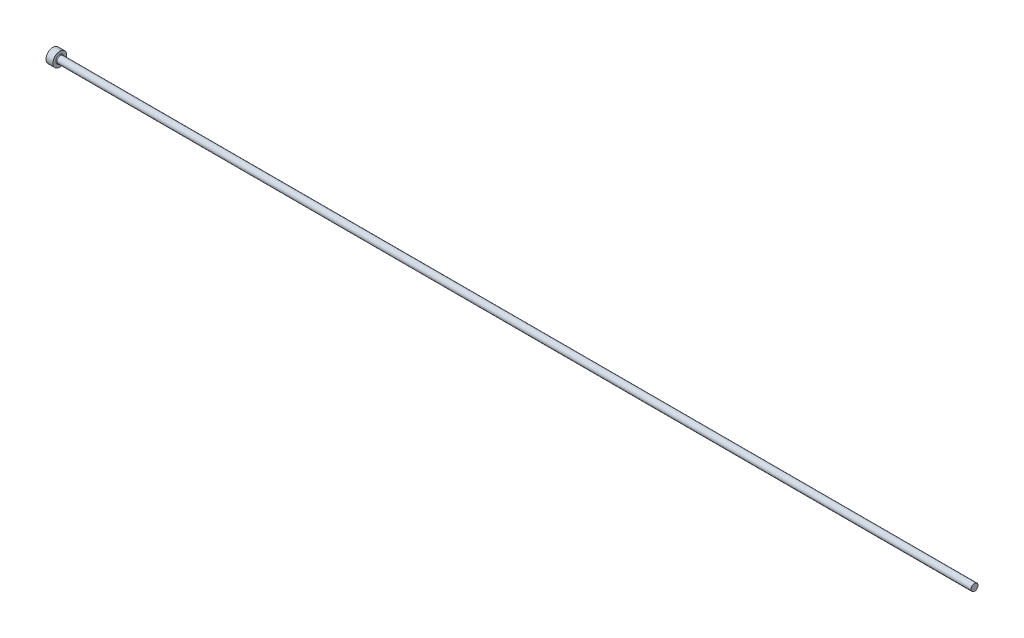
ISO-10303-21;
HEADER;
FILE_DESCRIPTION(('STEP AP214'),'2;1');
FILE_NAME('part.step','',(''),(''),'','','');
FILE_SCHEMA(('AUTOMOTIVE_DESIGN { 1 0 10303 214 1 1 1 1 }'));
ENDSEC;
DATA;
#1=APPLICATION_CONTEXT('core data for automotive mechanical design processes');
#2=APPLICATION_PROTOCOL_DEFINITION('international standard','automotive_design',2000,#1);
#3=PRODUCT_CONTEXT('',#1,'mechanical');
#4=PRODUCT('Part','Part','',(#3));
#5=PRODUCT_RELATED_PRODUCT_CATEGORY('part','',(#4));
#6=PRODUCT_DEFINITION_FORMATION('','',#4);
#7=PRODUCT_DEFINITION_CONTEXT('part definition',#1,'design');
#8=PRODUCT_DEFINITION('design','',#6,#7);
#9=PRODUCT_DEFINITION_SHAPE('','',#8);
#10=(LENGTH_UNIT() NAMED_UNIT(*) SI_UNIT(.MILLI.,.METRE.));
#11=(NAMED_UNIT(*) PLANE_ANGLE_UNIT() SI_UNIT($,.RADIAN.));
#12=(NAMED_UNIT(*) SI_UNIT($,.STERADIAN.) SOLID_ANGLE_UNIT());
#13=UNCERTAINTY_MEASURE_WITH_UNIT(LENGTH_MEASURE(1.E-05),#10,'distance_accuracy_value','');
#14=(GEOMETRIC_REPRESENTATION_CONTEXT(3) GLOBAL_UNCERTAINTY_ASSIGNED_CONTEXT((#13)) GLOBAL_UNIT_ASSIGNED_CONTEXT((#10,
#11,#12)) REPRESENTATION_CONTEXT('',''));
#15=CARTESIAN_POINT('',(0.,0.,0.));
#16=DIRECTION('',(0.,0.,1.));
#17=DIRECTION('',(1.,0.,0.));
#18=AXIS2_PLACEMENT_3D('',#15,#16,#17);
#19=CARTESIAN_POINT('',(0.,0.,0.));
#20=DIRECTION('',(-1.,0.,0.));
#21=DIRECTION('',(0.,-1.,0.));
#22=AXIS2_PLACEMENT_3D('',#19,#20,#21);
#23=PLANE('',#22);
#24=CARTESIAN_POINT('',(0.,0.,0.));
#25=DIRECTION('',(1.,0.,0.));
#26=DIRECTION('',(0.,1.,0.));
#27=AXIS2_PLACEMENT_3D('',#24,#25,#26);
#28=CIRCLE('',#27,3.);
#29=CARTESIAN_POINT('',(0.,3.,0.));
#30=VERTEX_POINT('',#29);
#31=EDGE_CURVE('E25',#30,#30,#28,.T.);
#32=ORIENTED_EDGE('',*,*,#31,.F.);
#33=EDGE_LOOP('',(#32));
#34=FACE_BOUND('',#33,.T.);
#35=ADVANCED_FACE('F14',(#34),#23,.T.);
#36=CARTESIAN_POINT('',(400.,0.,0.));
#37=DIRECTION('',(1.,0.,0.));
#38=DIRECTION('',(0.,1.,0.));
#39=AXIS2_PLACEMENT_3D('',#36,#37,#38);
#40=CYLINDRICAL_SURFACE('',#39,3.);
#41=ORIENTED_EDGE('',*,*,#31,.T.);
#42=EDGE_LOOP('',(#41));
#43=FACE_BOUND('',#42,.T.);
#44=CARTESIAN_POINT('',(3.,0.,0.));
#45=DIRECTION('',(1.,0.,0.));
#46=DIRECTION('',(0.,1.,0.));
#47=AXIS2_PLACEMENT_3D('',#44,#45,#46);
#48=CIRCLE('',#47,3.);
#49=CARTESIAN_POINT('',(3.,3.,0.));
#50=VERTEX_POINT('',#49);
#51=EDGE_CURVE('E29',#50,#50,#48,.T.);
#52=ORIENTED_EDGE('',*,*,#51,.F.);
#53=EDGE_LOOP('',(#52));
#54=FACE_BOUND('',#53,.T.);
#55=ADVANCED_FACE('F51',(#43,#54),#40,.T.);
#56=CARTESIAN_POINT('',(3.,3.,0.));
#57=DIRECTION('',(1.,0.,0.));
#58=DIRECTION('',(0.,1.,0.));
#59=AXIS2_PLACEMENT_3D('',#56,#57,#58);
#60=PLANE('',#59);
#61=CARTESIAN_POINT('',(3.,0.,0.));
#62=DIRECTION('',(1.,0.,0.));
#63=DIRECTION('',(0.,1.,0.));
#64=AXIS2_PLACEMENT_3D('',#61,#62,#63);
#65=CIRCLE('',#64,1.79999999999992);
#66=CARTESIAN_POINT('',(3.,1.79999999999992,0.));
#67=VERTEX_POINT('',#66);
#68=EDGE_CURVE('E9',#67,#67,#65,.F.);
#69=ORIENTED_EDGE('',*,*,#68,.T.);
#70=EDGE_LOOP('',(#69));
#71=FACE_BOUND('',#70,.T.);
#72=ORIENTED_EDGE('',*,*,#51,.T.);
#73=EDGE_LOOP('',(#72));
#74=FACE_BOUND('',#73,.T.);
#75=ADVANCED_FACE('F42',(#71,#74),#60,.T.);
#76=CARTESIAN_POINT('',(400.,0.,0.));
#77=DIRECTION('',(1.,0.,0.));
#78=DIRECTION('',(0.,1.,0.));
#79=AXIS2_PLACEMENT_3D('',#76,#77,#78);
#80=CYLINDRICAL_SURFACE('',#79,1.49999999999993);
#81=CARTESIAN_POINT('',(3.3,0.,0.));
#82=DIRECTION('',(1.,0.,0.));
#83=DIRECTION('',(0.,1.,0.));
#84=AXIS2_PLACEMENT_3D('',#81,#82,#83);
#85=CIRCLE('',#84,1.49999999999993);
#86=CARTESIAN_POINT('',(3.3,1.49999999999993,0.));
#87=VERTEX_POINT('',#86);
#88=EDGE_CURVE('E21',#87,#87,#85,.T.);
#89=ORIENTED_EDGE('',*,*,#88,.T.);
#90=EDGE_LOOP('',(#89));
#91=FACE_BOUND('',#90,.T.);
#92=CARTESIAN_POINT('',(400.,0.,0.));
#93=DIRECTION('',(1.,0.,0.));
#94=DIRECTION('',(0.,1.,0.));
#95=AXIS2_PLACEMENT_3D('',#92,#93,#94);
#96=CIRCLE('',#95,1.49999999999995);
#97=CARTESIAN_POINT('',(400.,1.49999999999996,0.));
#98=VERTEX_POINT('',#97);
#99=EDGE_CURVE('E34',#98,#98,#96,.T.);
#100=ORIENTED_EDGE('',*,*,#99,.F.);
#101=EDGE_LOOP('',(#100));
#102=FACE_BOUND('',#101,.T.);
#103=ADVANCED_FACE('F40',(#91,#102),#80,.T.);
#104=CARTESIAN_POINT('',(400.,1.49999999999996,0.));
#105=DIRECTION('',(1.,0.,0.));
#106=DIRECTION('',(0.,1.,0.));
#107=AXIS2_PLACEMENT_3D('',#104,#105,#106);
#108=PLANE('',#107);
#109=ORIENTED_EDGE('',*,*,#99,.T.);
#110=EDGE_LOOP('',(#109));
#111=FACE_BOUND('',#110,.T.);
#112=ADVANCED_FACE('F38',(#111),#108,.T.);
#113=CARTESIAN_POINT('',(3.3,0.,0.));
#114=DIRECTION('',(1.,0.,0.));
#115=DIRECTION('',(0.,1.,0.));
#116=AXIS2_PLACEMENT_3D('',#113,#114,#115);
#117=TOROIDAL_SURFACE('',#116,1.79999999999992,0.3);
#118=ORIENTED_EDGE('',*,*,#68,.F.);
#119=EDGE_LOOP('',(#118));
#120=FACE_BOUND('',#119,.T.);
#121=ORIENTED_EDGE('',*,*,#88,.F.);
#122=EDGE_LOOP('',(#121));
#123=FACE_BOUND('',#122,.T.);
#124=ADVANCED_FACE('F16',(#120,#123),#117,.F.);
#125=CLOSED_SHELL('',(#35,#55,#75,#103,#112,#124));
#126=MANIFOLD_SOLID_BREP('B1',#125);
#127=ADVANCED_BREP_SHAPE_REPRESENTATION('',(#18,#126),#14);
#128=SHAPE_DEFINITION_REPRESENTATION(#9,#127);
ENDSEC;
END-ISO-10303-21;
